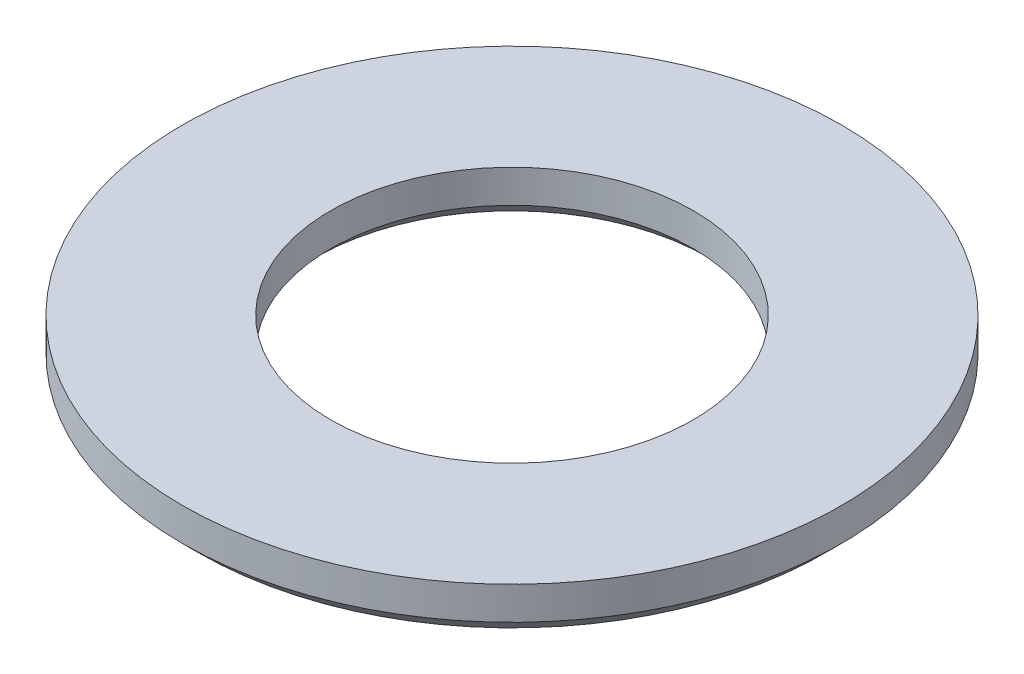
ISO-10303-21;
HEADER;
FILE_DESCRIPTION(('STEP AP214'),'2;1');
FILE_NAME('part.step','',(''),(''),'','','');
FILE_SCHEMA(('AUTOMOTIVE_DESIGN { 1 0 10303 214 1 1 1 1 }'));
ENDSEC;
DATA;
#1=APPLICATION_CONTEXT('core data for automotive mechanical design processes');
#2=APPLICATION_PROTOCOL_DEFINITION('international standard','automotive_design',2000,#1);
#3=PRODUCT_CONTEXT('',#1,'mechanical');
#4=PRODUCT('Part','Part','',(#3));
#5=PRODUCT_RELATED_PRODUCT_CATEGORY('part','',(#4));
#6=PRODUCT_DEFINITION_FORMATION('','',#4);
#7=PRODUCT_DEFINITION_CONTEXT('part definition',#1,'design');
#8=PRODUCT_DEFINITION('design','',#6,#7);
#9=PRODUCT_DEFINITION_SHAPE('','',#8);
#10=(LENGTH_UNIT() NAMED_UNIT(*) SI_UNIT(.MILLI.,.METRE.));
#11=(NAMED_UNIT(*) PLANE_ANGLE_UNIT() SI_UNIT($,.RADIAN.));
#12=(NAMED_UNIT(*) SI_UNIT($,.STERADIAN.) SOLID_ANGLE_UNIT());
#13=UNCERTAINTY_MEASURE_WITH_UNIT(LENGTH_MEASURE(1.E-05),#10,'distance_accuracy_value','');
#14=(GEOMETRIC_REPRESENTATION_CONTEXT(3) GLOBAL_UNCERTAINTY_ASSIGNED_CONTEXT((#13)) GLOBAL_UNIT_ASSIGNED_CONTEXT((#10,
#11,#12)) REPRESENTATION_CONTEXT('',''));
#15=CARTESIAN_POINT('',(0.,0.,0.));
#16=DIRECTION('',(0.,0.,1.));
#17=DIRECTION('',(1.,0.,0.));
#18=AXIS2_PLACEMENT_3D('',#15,#16,#17);
#19=CARTESIAN_POINT('',(0.,0.,0.));
#20=DIRECTION('',(0.,1.,0.));
#21=DIRECTION('',(0.,0.,1.));
#22=AXIS2_PLACEMENT_3D('',#19,#20,#21);
#23=PLANE('',#22);
#24=CARTESIAN_POINT('',(0.,-5.6843418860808E-11,0.));
#25=DIRECTION('',(0.,-1.,0.));
#26=DIRECTION('',(0.,0.,-1.));
#27=AXIS2_PLACEMENT_3D('',#24,#25,#26);
#28=CIRCLE('',#27,5.99999999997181);
#29=CARTESIAN_POINT('',(0.,-5.6843418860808E-11,-5.99999999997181));
#30=VERTEX_POINT('',#29);
#31=EDGE_CURVE('E31',#30,#30,#28,.F.);
#32=ORIENTED_EDGE('',*,*,#31,.T.);
#33=EDGE_LOOP('',(#32));
#34=FACE_BOUND('',#33,.T.);
#35=CARTESIAN_POINT('',(0.,-2.86229373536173E-13,0.));
#36=DIRECTION('',(0.,1.,0.));
#37=DIRECTION('',(0.,0.,1.));
#38=AXIS2_PLACEMENT_3D('',#35,#36,#37);
#39=CIRCLE('',#38,9.50000000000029);
#40=CARTESIAN_POINT('',(0.,-2.86229373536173E-13,9.50000000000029));
#41=VERTEX_POINT('',#40);
#42=EDGE_CURVE('E17',#41,#41,#39,.T.);
#43=ORIENTED_EDGE('',*,*,#42,.F.);
#44=EDGE_LOOP('',(#43));
#45=FACE_BOUND('',#44,.T.);
#46=ADVANCED_FACE('F14',(#34,#45),#23,.F.);
#47=CARTESIAN_POINT('',(0.,0.499999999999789,0.));
#48=DIRECTION('',(0.,1.,0.));
#49=DIRECTION('',(0.,0.,1.));
#50=AXIS2_PLACEMENT_3D('',#47,#48,#49);
#51=CONICAL_SURFACE('',#50,10.0000000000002,0.785398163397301);
#52=CARTESIAN_POINT('',(0.,0.5,0.));
#53=DIRECTION('',(0.,1.,0.));
#54=DIRECTION('',(0.,0.,1.));
#55=AXIS2_PLACEMENT_3D('',#52,#53,#54);
#56=CIRCLE('',#55,10.);
#57=CARTESIAN_POINT('',(0.,0.5,10.));
#58=VERTEX_POINT('',#57);
#59=EDGE_CURVE('E29',#58,#58,#56,.T.);
#60=ORIENTED_EDGE('',*,*,#59,.F.);
#61=EDGE_LOOP('',(#60));
#62=FACE_BOUND('',#61,.T.);
#63=ORIENTED_EDGE('',*,*,#42,.T.);
#64=EDGE_LOOP('',(#63));
#65=FACE_BOUND('',#64,.T.);
#66=ADVANCED_FACE('F39',(#62,#65),#51,.T.);
#67=CARTESIAN_POINT('',(0.,0.,0.));
#68=DIRECTION('',(0.,-1.,0.));
#69=DIRECTION('',(0.,0.,-1.));
#70=AXIS2_PLACEMENT_3D('',#67,#68,#69);
#71=CONICAL_SURFACE('',#70,5.99999999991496,0.785398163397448);
#72=CARTESIAN_POINT('',(0.,0.5,0.));
#73=DIRECTION('',(0.,1.,0.));
#74=DIRECTION('',(0.,0.,1.));
#75=AXIS2_PLACEMENT_3D('',#72,#73,#74);
#76=CIRCLE('',#75,5.5);
#77=CARTESIAN_POINT('',(0.,0.5,5.5));
#78=VERTEX_POINT('',#77);
#79=EDGE_CURVE('E26',#78,#78,#76,.T.);
#80=ORIENTED_EDGE('',*,*,#79,.T.);
#81=EDGE_LOOP('',(#80));
#82=FACE_BOUND('',#81,.T.);
#83=ORIENTED_EDGE('',*,*,#31,.F.);
#84=EDGE_LOOP('',(#83));
#85=FACE_BOUND('',#84,.T.);
#86=ADVANCED_FACE('F47',(#82,#85),#71,.F.);
#87=CARTESIAN_POINT('',(0.,0.,0.));
#88=DIRECTION('',(0.,1.,0.));
#89=DIRECTION('',(0.,0.,1.));
#90=AXIS2_PLACEMENT_3D('',#87,#88,#89);
#91=CYLINDRICAL_SURFACE('',#90,10.);
#92=CARTESIAN_POINT('',(0.,1.5,0.));
#93=DIRECTION('',(0.,1.,0.));
#94=DIRECTION('',(0.,0.,1.));
#95=AXIS2_PLACEMENT_3D('',#92,#93,#94);
#96=CIRCLE('',#95,10.);
#97=CARTESIAN_POINT('',(0.,1.5,10.));
#98=VERTEX_POINT('',#97);
#99=EDGE_CURVE('E21',#98,#98,#96,.T.);
#100=ORIENTED_EDGE('',*,*,#99,.F.);
#101=EDGE_LOOP('',(#100));
#102=FACE_BOUND('',#101,.T.);
#103=ORIENTED_EDGE('',*,*,#59,.T.);
#104=EDGE_LOOP('',(#103));
#105=FACE_BOUND('',#104,.T.);
#106=ADVANCED_FACE('F57',(#102,#105),#91,.T.);
#107=CARTESIAN_POINT('',(0.,0.,0.));
#108=DIRECTION('',(0.,1.,0.));
#109=DIRECTION('',(0.,0.,1.));
#110=AXIS2_PLACEMENT_3D('',#107,#108,#109);
#111=CYLINDRICAL_SURFACE('',#110,5.5);
#112=CARTESIAN_POINT('',(0.,1.5,0.));
#113=DIRECTION('',(0.,1.,0.));
#114=DIRECTION('',(0.,0.,1.));
#115=AXIS2_PLACEMENT_3D('',#112,#113,#114);
#116=CIRCLE('',#115,5.5);
#117=CARTESIAN_POINT('',(0.,1.5,5.5));
#118=VERTEX_POINT('',#117);
#119=EDGE_CURVE('E10',#118,#118,#116,.F.);
#120=ORIENTED_EDGE('',*,*,#119,.F.);
#121=EDGE_LOOP('',(#120));
#122=FACE_BOUND('',#121,.T.);
#123=ORIENTED_EDGE('',*,*,#79,.F.);
#124=EDGE_LOOP('',(#123));
#125=FACE_BOUND('',#124,.T.);
#126=ADVANCED_FACE('F51',(#122,#125),#111,.F.);
#127=CARTESIAN_POINT('',(0.,1.5,0.));
#128=DIRECTION('',(0.,1.,0.));
#129=DIRECTION('',(0.,0.,1.));
#130=AXIS2_PLACEMENT_3D('',#127,#128,#129);
#131=PLANE('',#130);
#132=ORIENTED_EDGE('',*,*,#119,.T.);
#133=EDGE_LOOP('',(#132));
#134=FACE_BOUND('',#133,.T.);
#135=ORIENTED_EDGE('',*,*,#99,.T.);
#136=EDGE_LOOP('',(#135));
#137=FACE_BOUND('',#136,.T.);
#138=ADVANCED_FACE('F49',(#134,#137),#131,.T.);
#139=CLOSED_SHELL('',(#46,#66,#86,#106,#126,#138));
#140=MANIFOLD_SOLID_BREP('B1',#139);
#141=ADVANCED_BREP_SHAPE_REPRESENTATION('',(#18,#140),#14);
#142=SHAPE_DEFINITION_REPRESENTATION(#9,#141);
ENDSEC;
END-ISO-10303-21;
